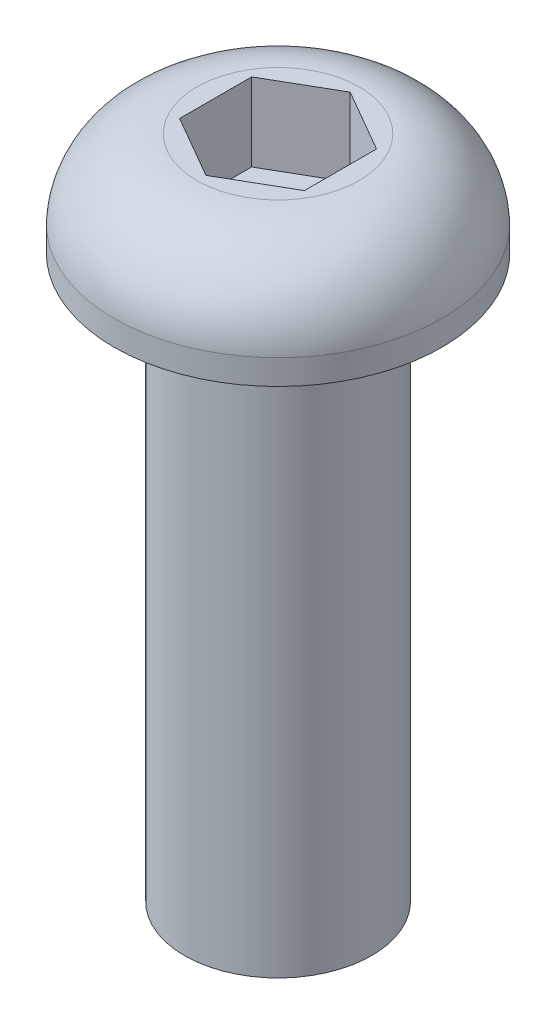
from build123d import *

# Parameters (mm, degrees)
HEXCUT_DEPTH = 2.5


with BuildPart() as part:
    # Sketch1 → Screw (revolve)
    with BuildSketch(Plane.XY, mode=Mode.PRIVATE) as screw_sk:
        with BuildLine():
            Line((0, 0), (2.6, 0))
            ThreePointArc((2.6, 0), (4.421572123, -0.723633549), (5.25, -2.5))
            Line((5.25, -2.5), (5.25, -3.3))
            Line((5.25, -3.3), (3, -3.3))
            Line((3, -3.3), (3, -21.3))
            Line((3, -21.3), (0, -21.3))
            Line((0, -21.3), (0, 0))
        make_face()
    revolve(screw_sk.sketch.rotate(Axis((0, 25.4, 0), (0, -1, 0)), 90), axis=Axis((0, 25.4, 0), (0, -1, 0)))

    # Sketch2 → HexCut (cut)
    with BuildSketch(Plane(origin=(0, 0, 0), x_dir=(-1, 0, 0), z_dir=(0, 1, 0))):
        Polygon((-2, -1.154700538), (-2, 1.154700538), (0, 2.309401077), (2, 1.154700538), (2, -1.154700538), (0, -2.309401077), align=None)
    extrude(amount=-HEXCUT_DEPTH, mode=Mode.SUBTRACT)


solid = part.part
